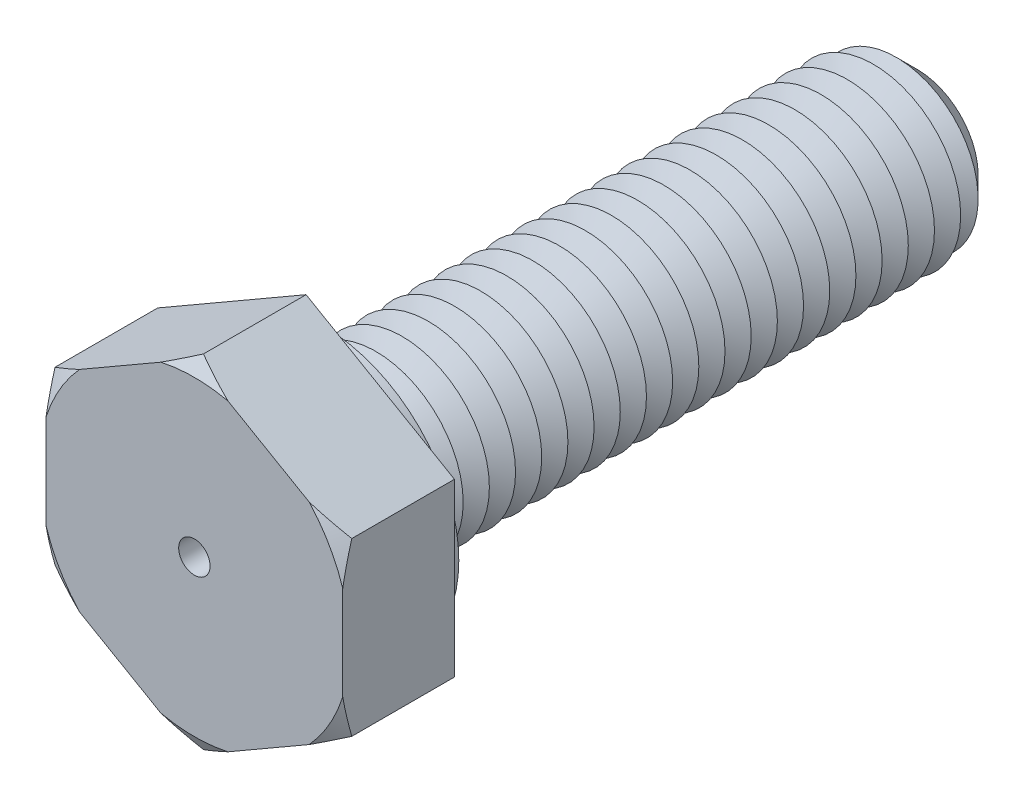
from build123d import *

# Parameters (mm, degrees)
BOSS_EXTRUDE1_DEPTH = 6.4
SKETCH3_R           = 5
BOSS_EXTRUDE2_DEPTH = 35
SKETCH4_R           = 7.75
BOSS_EXTRUDE3_DEPTH = 1
CHAMFER1_SIZE       = 1.5
LPATTERN1_COUNT     = 22
LPATTERN1_PITCH     = 1.5
SKETCH8_R           = 0.9
CUT_EXTRUDE1_DEPTH  = 41.4


with BuildPart() as part:
    # Sketch2 → Boss-Extrude1 (new body)
    with BuildSketch(Plane.XY):
        Polygon((0, 9.814954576), (-8.5, 4.907477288), (-8.5, -4.907477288), (0, -9.814954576), (8.5, -4.907477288), (8.5, 4.907477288), align=None)
    extrude(amount=BOSS_EXTRUDE1_DEPTH)

    # Sketch3 → Boss-Extrude2 (add)
    with BuildSketch(Plane(origin=(0, 0, 0), x_dir=(-1, 0, 0), z_dir=(0, 0, -1))):
        Circle(SKETCH3_R)
    extrude(amount=BOSS_EXTRUDE2_DEPTH)

    # Sketch4 → Boss-Extrude3 (add)
    with BuildSketch(Plane(origin=(0, 0, 0), x_dir=(-1, 0, 0), z_dir=(0, 0, -1))):
        with Locations(Location((0, 0, 0), (0, 0, 180))):
            Circle(SKETCH4_R)
    extrude(amount=BOSS_EXTRUDE3_DEPTH)

    # Chamfer1
    chamfer1_edges = [part.edges().sort_by_distance(p)[0] for p in [
        (5, 0, -35),
    ]]
    chamfer(chamfer1_edges, length=CHAMFER1_SIZE)

    # Sketch6 → Cut-Revolve1 (revolve, cut)
    with BuildSketch(Plane(origin=(0, 0, 0), x_dir=(0, 0, -1), z_dir=(1, 0, 0)), mode=Mode.PRIVATE) as cut_revolve1_sk:
        Polygon((1, 5), (1.75, 3.700961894), (2.5, 5), align=None)
    cut_revolve1 = revolve(cut_revolve1_sk.sketch.rotate(Axis((0, 0, 3.211670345), (0, 0, -1)), 90), axis=Axis((0, 0, 3.211670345), (0, 0, -1)), mode=Mode.SUBTRACT)

    # LPattern1: Cut-Revolve1 ×22
    with Locations(*[(0, 0, -i * LPATTERN1_PITCH) for i in range(1, LPATTERN1_COUNT)]):
        add(cut_revolve1, mode=Mode.SUBTRACT)

    # Sketch7 → Cut-Revolve2 (revolve, cut)
    with BuildSketch(Plane(origin=(0, 0, 0), x_dir=(0, 0, -1), z_dir=(1, 0, 0)), mode=Mode.PRIVATE) as cut_revolve2_sk:
        Polygon((-6.4, 9.814954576), (-6.4, 8.914954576), (-5.880384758, 9.814954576), align=None)
    revolve(cut_revolve2_sk.sketch.rotate(Axis((0, 0, 3.211670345), (0, 0, -1)), 270), axis=Axis((0, 0, 3.211670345), (0, 0, -1)), mode=Mode.SUBTRACT)

    # Sketch8 → Cut-Extrude1 (cut)
    with BuildSketch(Plane.XY.offset(6.4)):
        Circle(SKETCH8_R)
    extrude(amount=-CUT_EXTRUDE1_DEPTH, mode=Mode.SUBTRACT)


solid = part.part
